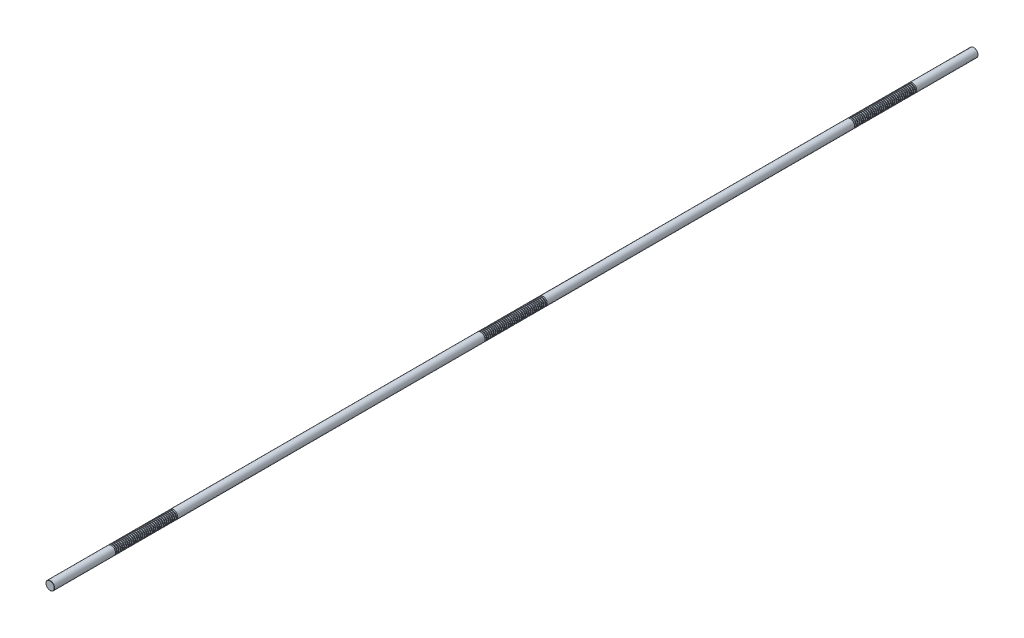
from build123d import *

# Parameters (mm, degrees)
SKETCH1_R           = 7
BOSS_EXTRUDE1_DEPTH = 750
CHAMFER1_SIZE       = 0.35
LPATTERN1_COUNT     = 34
LPATTERN1_PITCH     = 3
LPATTERN2_COUNT     = 3
LPATTERN2_PITCH     = 600


with BuildPart() as part:
    # Sketch1 → Boss-Extrude1 (new, symmetric)
    with BuildSketch(Plane.XY):
        Circle(SKETCH1_R)
    extrude(amount=BOSS_EXTRUDE1_DEPTH, both=True)

    # Chamfer1
    chamfer1_edges = [part.edges().sort_by_distance(p)[0] for p in [
        (-7, 0, -750),
        (-7, 0, 750),
    ]]
    chamfer(chamfer1_edges, length=CHAMFER1_SIZE)

    # Sketch2 → Cut-Revolve1 (revolve, cut)
    with BuildSketch(Plane(origin=(0, 0, 0), x_dir=(0, 0, -1), z_dir=(1, 0, 0)), mode=Mode.PRIVATE) as cut_revolve1_sk:
        Polygon((650.234455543, 7), (648.265544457, 7), (648.734455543, 5.25), (649.765544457, 5.25), align=None)
    cut_revolve1 = revolve(cut_revolve1_sk.sketch.rotate(Axis((0, 0, 750), (0, 0, -1)), 90), axis=Axis((0, 0, 750), (0, 0, -1)), mode=Mode.SUBTRACT)

    # LPattern1: Cut-Revolve1 ×34
    with Locations(*[(0, 0, i * LPATTERN1_PITCH) for i in range(1, LPATTERN1_COUNT)]):
        add(cut_revolve1, mode=Mode.SUBTRACT)

    # LPattern2: Cut-Revolve1 ×3
    with Locations(*[(0, 0, i * LPATTERN2_PITCH) for i in range(1, LPATTERN2_COUNT)]):
        add(cut_revolve1, mode=Mode.SUBTRACT)

    # LPattern2 copy 1 sketch → LPattern2 copy 1 (revolve, cut)
    with BuildSketch(Plane(origin=(0, 0, 603), x_dir=(0, 0, -1), z_dir=(1, 0, 0))):
        Polygon((650.234455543, 7), (648.265544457, 7), (648.734455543, 5.25), (649.765544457, 5.25), align=None)
    revolve(axis=Axis((0, 0, 1353), (0, 0, -1)), mode=Mode.SUBTRACT)

    # LPattern2 copy 2 sketch → LPattern2 copy 2 (revolve, cut)
    with BuildSketch(Plane(origin=(0, 0, 1203), x_dir=(0, 0, -1), z_dir=(1, 0, 0))):
        Polygon((650.234455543, 7), (648.265544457, 7), (648.734455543, 5.25), (649.765544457, 5.25), align=None)
    revolve(axis=Axis((0, 0, 1953), (0, 0, -1)), mode=Mode.SUBTRACT)

    # LPattern2 copy 3 sketch → LPattern2 copy 3 (revolve, cut)
    with BuildSketch(Plane(origin=(0, 0, 606), x_dir=(0, 0, -1), z_dir=(1, 0, 0))):
        Polygon((650.234455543, 7), (648.265544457, 7), (648.734455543, 5.25), (649.765544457, 5.25), align=None)
    revolve(axis=Axis((0, 0, 1356), (0, 0, -1)), mode=Mode.SUBTRACT)

    # LPattern2 copy 4 sketch → LPattern2 copy 4 (revolve, cut)
    with BuildSketch(Plane(origin=(0, 0, 1206), x_dir=(0, 0, -1), z_dir=(1, 0, 0))):
        Polygon((650.234455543, 7), (648.265544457, 7), (648.734455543, 5.25), (649.765544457, 5.25), align=None)
    revolve(axis=Axis((0, 0, 1956), (0, 0, -1)), mode=Mode.SUBTRACT)

    # LPattern2 copy 5 sketch → LPattern2 copy 5 (revolve, cut)
    with BuildSketch(Plane(origin=(0, 0, 609), x_dir=(0, 0, -1), z_dir=(1, 0, 0))):
        Polygon((650.234455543, 7), (648.265544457, 7), (648.734455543, 5.25), (649.765544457, 5.25), align=None)
    revolve(axis=Axis((0, 0, 1359), (0, 0, -1)), mode=Mode.SUBTRACT)

    # LPattern2 copy 6 sketch → LPattern2 copy 6 (revolve, cut)
    with BuildSketch(Plane(origin=(0, 0, 1209), x_dir=(0, 0, -1), z_dir=(1, 0, 0))):
        Polygon((650.234455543, 7), (648.265544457, 7), (648.734455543, 5.25), (649.765544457, 5.25), align=None)
    revolve(axis=Axis((0, 0, 1959), (0, 0, -1)), mode=Mode.SUBTRACT)

    # LPattern2 copy 7 sketch → LPattern2 copy 7 (revolve, cut)
    with BuildSketch(Plane(origin=(0, 0, 612), x_dir=(0, 0, -1), z_dir=(1, 0, 0))):
        Polygon((650.234455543, 7), (648.265544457, 7), (648.734455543, 5.25), (649.765544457, 5.25), align=None)
    revolve(axis=Axis((0, 0, 1362), (0, 0, -1)), mode=Mode.SUBTRACT)

    # LPattern2 copy 8 sketch → LPattern2 copy 8 (revolve, cut)
    with BuildSketch(Plane(origin=(0, 0, 1212), x_dir=(0, 0, -1), z_dir=(1, 0, 0))):
        Polygon((650.234455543, 7), (648.265544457, 7), (648.734455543, 5.25), (649.765544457, 5.25), align=None)
    revolve(axis=Axis((0, 0, 1962), (0, 0, -1)), mode=Mode.SUBTRACT)

    # LPattern2 copy 9 sketch → LPattern2 copy 9 (revolve, cut)
    with BuildSketch(Plane(origin=(0, 0, 615), x_dir=(0, 0, -1), z_dir=(1, 0, 0))):
        Polygon((650.234455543, 7), (648.265544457, 7), (648.734455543, 5.25), (649.765544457, 5.25), align=None)
    revolve(axis=Axis((0, 0, 1365), (0, 0, -1)), mode=Mode.SUBTRACT)

    # LPattern2 copy 10 sketch → LPattern2 copy 10 (revolve, cut)
    with BuildSketch(Plane(origin=(0, 0, 1215), x_dir=(0, 0, -1), z_dir=(1, 0, 0))):
        Polygon((650.234455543, 7), (648.265544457, 7), (648.734455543, 5.25), (649.765544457, 5.25), align=None)
    revolve(axis=Axis((0, 0, 1965), (0, 0, -1)), mode=Mode.SUBTRACT)

    # LPattern2 copy 11 sketch → LPattern2 copy 11 (revolve, cut)
    with BuildSketch(Plane(origin=(0, 0, 618), x_dir=(0, 0, -1), z_dir=(1, 0, 0))):
        Polygon((650.234455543, 7), (648.265544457, 7), (648.734455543, 5.25), (649.765544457, 5.25), align=None)
    revolve(axis=Axis((0, 0, 1368), (0, 0, -1)), mode=Mode.SUBTRACT)

    # LPattern2 copy 12 sketch → LPattern2 copy 12 (revolve, cut)
    with BuildSketch(Plane(origin=(0, 0, 1218), x_dir=(0, 0, -1), z_dir=(1, 0, 0))):
        Polygon((650.234455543, 7), (648.265544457, 7), (648.734455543, 5.25), (649.765544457, 5.25), align=None)
    revolve(axis=Axis((0, 0, 1968), (0, 0, -1)), mode=Mode.SUBTRACT)

    # LPattern2 copy 13 sketch → LPattern2 copy 13 (revolve, cut)
    with BuildSketch(Plane(origin=(0, 0, 621), x_dir=(0, 0, -1), z_dir=(1, 0, 0))):
        Polygon((650.234455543, 7), (648.265544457, 7), (648.734455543, 5.25), (649.765544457, 5.25), align=None)
    revolve(axis=Axis((0, 0, 1371), (0, 0, -1)), mode=Mode.SUBTRACT)

    # LPattern2 copy 14 sketch → LPattern2 copy 14 (revolve, cut)
    with BuildSketch(Plane(origin=(0, 0, 1221), x_dir=(0, 0, -1), z_dir=(1, 0, 0))):
        Polygon((650.234455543, 7), (648.265544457, 7), (648.734455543, 5.25), (649.765544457, 5.25), align=None)
    revolve(axis=Axis((0, 0, 1971), (0, 0, -1)), mode=Mode.SUBTRACT)

    # LPattern2 copy 15 sketch → LPattern2 copy 15 (revolve, cut)
    with BuildSketch(Plane(origin=(0, 0, 624), x_dir=(0, 0, -1), z_dir=(1, 0, 0))):
        Polygon((650.234455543, 7), (648.265544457, 7), (648.734455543, 5.25), (649.765544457, 5.25), align=None)
    revolve(axis=Axis((0, 0, 1374), (0, 0, -1)), mode=Mode.SUBTRACT)

    # LPattern2 copy 16 sketch → LPattern2 copy 16 (revolve, cut)
    with BuildSketch(Plane(origin=(0, 0, 1224), x_dir=(0, 0, -1), z_dir=(1, 0, 0))):
        Polygon((650.234455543, 7), (648.265544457, 7), (648.734455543, 5.25), (649.765544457, 5.25), align=None)
    revolve(axis=Axis((0, 0, 1974), (0, 0, -1)), mode=Mode.SUBTRACT)

    # LPattern2 copy 17 sketch → LPattern2 copy 17 (revolve, cut)
    with BuildSketch(Plane(origin=(0, 0, 627), x_dir=(0, 0, -1), z_dir=(1, 0, 0))):
        Polygon((650.234455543, 7), (648.265544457, 7), (648.734455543, 5.25), (649.765544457, 5.25), align=None)
    revolve(axis=Axis((0, 0, 1377), (0, 0, -1)), mode=Mode.SUBTRACT)

    # LPattern2 copy 18 sketch → LPattern2 copy 18 (revolve, cut)
    with BuildSketch(Plane(origin=(0, 0, 1227), x_dir=(0, 0, -1), z_dir=(1, 0, 0))):
        Polygon((650.234455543, 7), (648.265544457, 7), (648.734455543, 5.25), (649.765544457, 5.25), align=None)
    revolve(axis=Axis((0, 0, 1977), (0, 0, -1)), mode=Mode.SUBTRACT)

    # LPattern2 copy 19 sketch → LPattern2 copy 19 (revolve, cut)
    with BuildSketch(Plane(origin=(0, 0, 630), x_dir=(0, 0, -1), z_dir=(1, 0, 0))):
        Polygon((650.234455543, 7), (648.265544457, 7), (648.734455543, 5.25), (649.765544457, 5.25), align=None)
    revolve(axis=Axis((0, 0, 1380), (0, 0, -1)), mode=Mode.SUBTRACT)

    # LPattern2 copy 20 sketch → LPattern2 copy 20 (revolve, cut)
    with BuildSketch(Plane(origin=(0, 0, 1230), x_dir=(0, 0, -1), z_dir=(1, 0, 0))):
        Polygon((650.234455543, 7), (648.265544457, 7), (648.734455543, 5.25), (649.765544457, 5.25), align=None)
    revolve(axis=Axis((0, 0, 1980), (0, 0, -1)), mode=Mode.SUBTRACT)

    # LPattern2 copy 21 sketch → LPattern2 copy 21 (revolve, cut)
    with BuildSketch(Plane(origin=(0, 0, 633), x_dir=(0, 0, -1), z_dir=(1, 0, 0))):
        Polygon((650.234455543, 7), (648.265544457, 7), (648.734455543, 5.25), (649.765544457, 5.25), align=None)
    revolve(axis=Axis((0, 0, 1383), (0, 0, -1)), mode=Mode.SUBTRACT)

    # LPattern2 copy 22 sketch → LPattern2 copy 22 (revolve, cut)
    with BuildSketch(Plane(origin=(0, 0, 1233), x_dir=(0, 0, -1), z_dir=(1, 0, 0))):
        Polygon((650.234455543, 7), (648.265544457, 7), (648.734455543, 5.25), (649.765544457, 5.25), align=None)
    revolve(axis=Axis((0, 0, 1983), (0, 0, -1)), mode=Mode.SUBTRACT)

    # LPattern2 copy 23 sketch → LPattern2 copy 23 (revolve, cut)
    with BuildSketch(Plane(origin=(0, 0, 636), x_dir=(0, 0, -1), z_dir=(1, 0, 0))):
        Polygon((650.234455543, 7), (648.265544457, 7), (648.734455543, 5.25), (649.765544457, 5.25), align=None)
    revolve(axis=Axis((0, 0, 1386), (0, 0, -1)), mode=Mode.SUBTRACT)

    # LPattern2 copy 24 sketch → LPattern2 copy 24 (revolve, cut)
    with BuildSketch(Plane(origin=(0, 0, 1236), x_dir=(0, 0, -1), z_dir=(1, 0, 0))):
        Polygon((650.234455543, 7), (648.265544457, 7), (648.734455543, 5.25), (649.765544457, 5.25), align=None)
    revolve(axis=Axis((0, 0, 1986), (0, 0, -1)), mode=Mode.SUBTRACT)

    # LPattern2 copy 25 sketch → LPattern2 copy 25 (revolve, cut)
    with BuildSketch(Plane(origin=(0, 0, 639), x_dir=(0, 0, -1), z_dir=(1, 0, 0))):
        Polygon((650.234455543, 7), (648.265544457, 7), (648.734455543, 5.25), (649.765544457, 5.25), align=None)
    revolve(axis=Axis((0, 0, 1389), (0, 0, -1)), mode=Mode.SUBTRACT)

    # LPattern2 copy 26 sketch → LPattern2 copy 26 (revolve, cut)
    with BuildSketch(Plane(origin=(0, 0, 1239), x_dir=(0, 0, -1), z_dir=(1, 0, 0))):
        Polygon((650.234455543, 7), (648.265544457, 7), (648.734455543, 5.25), (649.765544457, 5.25), align=None)
    revolve(axis=Axis((0, 0, 1989), (0, 0, -1)), mode=Mode.SUBTRACT)

    # LPattern2 copy 27 sketch → LPattern2 copy 27 (revolve, cut)
    with BuildSketch(Plane(origin=(0, 0, 642), x_dir=(0, 0, -1), z_dir=(1, 0, 0))):
        Polygon((650.234455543, 7), (648.265544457, 7), (648.734455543, 5.25), (649.765544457, 5.25), align=None)
    revolve(axis=Axis((0, 0, 1392), (0, 0, -1)), mode=Mode.SUBTRACT)

    # LPattern2 copy 28 sketch → LPattern2 copy 28 (revolve, cut)
    with BuildSketch(Plane(origin=(0, 0, 1242), x_dir=(0, 0, -1), z_dir=(1, 0, 0))):
        Polygon((650.234455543, 7), (648.265544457, 7), (648.734455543, 5.25), (649.765544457, 5.25), align=None)
    revolve(axis=Axis((0, 0, 1992), (0, 0, -1)), mode=Mode.SUBTRACT)

    # LPattern2 copy 29 sketch → LPattern2 copy 29 (revolve, cut)
    with BuildSketch(Plane(origin=(0, 0, 645), x_dir=(0, 0, -1), z_dir=(1, 0, 0))):
        Polygon((650.234455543, 7), (648.265544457, 7), (648.734455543, 5.25), (649.765544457, 5.25), align=None)
    revolve(axis=Axis((0, 0, 1395), (0, 0, -1)), mode=Mode.SUBTRACT)

    # LPattern2 copy 30 sketch → LPattern2 copy 30 (revolve, cut)
    with BuildSketch(Plane(origin=(0, 0, 1245), x_dir=(0, 0, -1), z_dir=(1, 0, 0))):
        Polygon((650.234455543, 7), (648.265544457, 7), (648.734455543, 5.25), (649.765544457, 5.25), align=None)
    revolve(axis=Axis((0, 0, 1995), (0, 0, -1)), mode=Mode.SUBTRACT)

    # LPattern2 copy 31 sketch → LPattern2 copy 31 (revolve, cut)
    with BuildSketch(Plane(origin=(0, 0, 648), x_dir=(0, 0, -1), z_dir=(1, 0, 0))):
        Polygon((650.234455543, 7), (648.265544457, 7), (648.734455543, 5.25), (649.765544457, 5.25), align=None)
    revolve(axis=Axis((0, 0, 1398), (0, 0, -1)), mode=Mode.SUBTRACT)

    # LPattern2 copy 32 sketch → LPattern2 copy 32 (revolve, cut)
    with BuildSketch(Plane(origin=(0, 0, 1248), x_dir=(0, 0, -1), z_dir=(1, 0, 0))):
        Polygon((650.234455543, 7), (648.265544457, 7), (648.734455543, 5.25), (649.765544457, 5.25), align=None)
    revolve(axis=Axis((0, 0, 1998), (0, 0, -1)), mode=Mode.SUBTRACT)

    # LPattern2 copy 33 sketch → LPattern2 copy 33 (revolve, cut)
    with BuildSketch(Plane(origin=(0, 0, 651), x_dir=(0, 0, -1), z_dir=(1, 0, 0))):
        Polygon((650.234455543, 7), (648.265544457, 7), (648.734455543, 5.25), (649.765544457, 5.25), align=None)
    revolve(axis=Axis((0, 0, 1401), (0, 0, -1)), mode=Mode.SUBTRACT)

    # LPattern2 copy 34 sketch → LPattern2 copy 34 (revolve, cut)
    with BuildSketch(Plane(origin=(0, 0, 1251), x_dir=(0, 0, -1), z_dir=(1, 0, 0))):
        Polygon((650.234455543, 7), (648.265544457, 7), (648.734455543, 5.25), (649.765544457, 5.25), align=None)
    revolve(axis=Axis((0, 0, 2001), (0, 0, -1)), mode=Mode.SUBTRACT)

    # LPattern2 copy 35 sketch → LPattern2 copy 35 (revolve, cut)
    with BuildSketch(Plane(origin=(0, 0, 654), x_dir=(0, 0, -1), z_dir=(1, 0, 0))):
        Polygon((650.234455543, 7), (648.265544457, 7), (648.734455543, 5.25), (649.765544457, 5.25), align=None)
    revolve(axis=Axis((0, 0, 1404), (0, 0, -1)), mode=Mode.SUBTRACT)

    # LPattern2 copy 36 sketch → LPattern2 copy 36 (revolve, cut)
    with BuildSketch(Plane(origin=(0, 0, 1254), x_dir=(0, 0, -1), z_dir=(1, 0, 0))):
        Polygon((650.234455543, 7), (648.265544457, 7), (648.734455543, 5.25), (649.765544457, 5.25), align=None)
    revolve(axis=Axis((0, 0, 2004), (0, 0, -1)), mode=Mode.SUBTRACT)

    # LPattern2 copy 37 sketch → LPattern2 copy 37 (revolve, cut)
    with BuildSketch(Plane(origin=(0, 0, 657), x_dir=(0, 0, -1), z_dir=(1, 0, 0))):
        Polygon((650.234455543, 7), (648.265544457, 7), (648.734455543, 5.25), (649.765544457, 5.25), align=None)
    revolve(axis=Axis((0, 0, 1407), (0, 0, -1)), mode=Mode.SUBTRACT)

    # LPattern2 copy 38 sketch → LPattern2 copy 38 (revolve, cut)
    with BuildSketch(Plane(origin=(0, 0, 1257), x_dir=(0, 0, -1), z_dir=(1, 0, 0))):
        Polygon((650.234455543, 7), (648.265544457, 7), (648.734455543, 5.25), (649.765544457, 5.25), align=None)
    revolve(axis=Axis((0, 0, 2007), (0, 0, -1)), mode=Mode.SUBTRACT)

    # LPattern2 copy 39 sketch → LPattern2 copy 39 (revolve, cut)
    with BuildSketch(Plane(origin=(0, 0, 660), x_dir=(0, 0, -1), z_dir=(1, 0, 0))):
        Polygon((650.234455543, 7), (648.265544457, 7), (648.734455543, 5.25), (649.765544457, 5.25), align=None)
    revolve(axis=Axis((0, 0, 1410), (0, 0, -1)), mode=Mode.SUBTRACT)

    # LPattern2 copy 40 sketch → LPattern2 copy 40 (revolve, cut)
    with BuildSketch(Plane(origin=(0, 0, 1260), x_dir=(0, 0, -1), z_dir=(1, 0, 0))):
        Polygon((650.234455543, 7), (648.265544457, 7), (648.734455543, 5.25), (649.765544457, 5.25), align=None)
    revolve(axis=Axis((0, 0, 2010), (0, 0, -1)), mode=Mode.SUBTRACT)

    # LPattern2 copy 41 sketch → LPattern2 copy 41 (revolve, cut)
    with BuildSketch(Plane(origin=(0, 0, 663), x_dir=(0, 0, -1), z_dir=(1, 0, 0))):
        Polygon((650.234455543, 7), (648.265544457, 7), (648.734455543, 5.25), (649.765544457, 5.25), align=None)
    revolve(axis=Axis((0, 0, 1413), (0, 0, -1)), mode=Mode.SUBTRACT)

    # LPattern2 copy 42 sketch → LPattern2 copy 42 (revolve, cut)
    with BuildSketch(Plane(origin=(0, 0, 1263), x_dir=(0, 0, -1), z_dir=(1, 0, 0))):
        Polygon((650.234455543, 7), (648.265544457, 7), (648.734455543, 5.25), (649.765544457, 5.25), align=None)
    revolve(axis=Axis((0, 0, 2013), (0, 0, -1)), mode=Mode.SUBTRACT)

    # LPattern2 copy 43 sketch → LPattern2 copy 43 (revolve, cut)
    with BuildSketch(Plane(origin=(0, 0, 666), x_dir=(0, 0, -1), z_dir=(1, 0, 0))):
        Polygon((650.234455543, 7), (648.265544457, 7), (648.734455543, 5.25), (649.765544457, 5.25), align=None)
    revolve(axis=Axis((0, 0, 1416), (0, 0, -1)), mode=Mode.SUBTRACT)

    # LPattern2 copy 44 sketch → LPattern2 copy 44 (revolve, cut)
    with BuildSketch(Plane(origin=(0, 0, 1266), x_dir=(0, 0, -1), z_dir=(1, 0, 0))):
        Polygon((650.234455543, 7), (648.265544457, 7), (648.734455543, 5.25), (649.765544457, 5.25), align=None)
    revolve(axis=Axis((0, 0, 2016), (0, 0, -1)), mode=Mode.SUBTRACT)

    # LPattern2 copy 45 sketch → LPattern2 copy 45 (revolve, cut)
    with BuildSketch(Plane(origin=(0, 0, 669), x_dir=(0, 0, -1), z_dir=(1, 0, 0))):
        Polygon((650.234455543, 7), (648.265544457, 7), (648.734455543, 5.25), (649.765544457, 5.25), align=None)
    revolve(axis=Axis((0, 0, 1419), (0, 0, -1)), mode=Mode.SUBTRACT)

    # LPattern2 copy 46 sketch → LPattern2 copy 46 (revolve, cut)
    with BuildSketch(Plane(origin=(0, 0, 1269), x_dir=(0, 0, -1), z_dir=(1, 0, 0))):
        Polygon((650.234455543, 7), (648.265544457, 7), (648.734455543, 5.25), (649.765544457, 5.25), align=None)
    revolve(axis=Axis((0, 0, 2019), (0, 0, -1)), mode=Mode.SUBTRACT)

    # LPattern2 copy 47 sketch → LPattern2 copy 47 (revolve, cut)
    with BuildSketch(Plane(origin=(0, 0, 672), x_dir=(0, 0, -1), z_dir=(1, 0, 0))):
        Polygon((650.234455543, 7), (648.265544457, 7), (648.734455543, 5.25), (649.765544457, 5.25), align=None)
    revolve(axis=Axis((0, 0, 1422), (0, 0, -1)), mode=Mode.SUBTRACT)

    # LPattern2 copy 48 sketch → LPattern2 copy 48 (revolve, cut)
    with BuildSketch(Plane(origin=(0, 0, 1272), x_dir=(0, 0, -1), z_dir=(1, 0, 0))):
        Polygon((650.234455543, 7), (648.265544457, 7), (648.734455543, 5.25), (649.765544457, 5.25), align=None)
    revolve(axis=Axis((0, 0, 2022), (0, 0, -1)), mode=Mode.SUBTRACT)

    # LPattern2 copy 49 sketch → LPattern2 copy 49 (revolve, cut)
    with BuildSketch(Plane(origin=(0, 0, 675), x_dir=(0, 0, -1), z_dir=(1, 0, 0))):
        Polygon((650.234455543, 7), (648.265544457, 7), (648.734455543, 5.25), (649.765544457, 5.25), align=None)
    revolve(axis=Axis((0, 0, 1425), (0, 0, -1)), mode=Mode.SUBTRACT)

    # LPattern2 copy 50 sketch → LPattern2 copy 50 (revolve, cut)
    with BuildSketch(Plane(origin=(0, 0, 1275), x_dir=(0, 0, -1), z_dir=(1, 0, 0))):
        Polygon((650.234455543, 7), (648.265544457, 7), (648.734455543, 5.25), (649.765544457, 5.25), align=None)
    revolve(axis=Axis((0, 0, 2025), (0, 0, -1)), mode=Mode.SUBTRACT)

    # LPattern2 copy 51 sketch → LPattern2 copy 51 (revolve, cut)
    with BuildSketch(Plane(origin=(0, 0, 678), x_dir=(0, 0, -1), z_dir=(1, 0, 0))):
        Polygon((650.234455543, 7), (648.265544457, 7), (648.734455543, 5.25), (649.765544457, 5.25), align=None)
    revolve(axis=Axis((0, 0, 1428), (0, 0, -1)), mode=Mode.SUBTRACT)

    # LPattern2 copy 52 sketch → LPattern2 copy 52 (revolve, cut)
    with BuildSketch(Plane(origin=(0, 0, 1278), x_dir=(0, 0, -1), z_dir=(1, 0, 0))):
        Polygon((650.234455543, 7), (648.265544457, 7), (648.734455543, 5.25), (649.765544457, 5.25), align=None)
    revolve(axis=Axis((0, 0, 2028), (0, 0, -1)), mode=Mode.SUBTRACT)

    # LPattern2 copy 53 sketch → LPattern2 copy 53 (revolve, cut)
    with BuildSketch(Plane(origin=(0, 0, 681), x_dir=(0, 0, -1), z_dir=(1, 0, 0))):
        Polygon((650.234455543, 7), (648.265544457, 7), (648.734455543, 5.25), (649.765544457, 5.25), align=None)
    revolve(axis=Axis((0, 0, 1431), (0, 0, -1)), mode=Mode.SUBTRACT)

    # LPattern2 copy 54 sketch → LPattern2 copy 54 (revolve, cut)
    with BuildSketch(Plane(origin=(0, 0, 1281), x_dir=(0, 0, -1), z_dir=(1, 0, 0))):
        Polygon((650.234455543, 7), (648.265544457, 7), (648.734455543, 5.25), (649.765544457, 5.25), align=None)
    revolve(axis=Axis((0, 0, 2031), (0, 0, -1)), mode=Mode.SUBTRACT)

    # LPattern2 copy 55 sketch → LPattern2 copy 55 (revolve, cut)
    with BuildSketch(Plane(origin=(0, 0, 684), x_dir=(0, 0, -1), z_dir=(1, 0, 0))):
        Polygon((650.234455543, 7), (648.265544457, 7), (648.734455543, 5.25), (649.765544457, 5.25), align=None)
    revolve(axis=Axis((0, 0, 1434), (0, 0, -1)), mode=Mode.SUBTRACT)

    # LPattern2 copy 56 sketch → LPattern2 copy 56 (revolve, cut)
    with BuildSketch(Plane(origin=(0, 0, 1284), x_dir=(0, 0, -1), z_dir=(1, 0, 0))):
        Polygon((650.234455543, 7), (648.265544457, 7), (648.734455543, 5.25), (649.765544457, 5.25), align=None)
    revolve(axis=Axis((0, 0, 2034), (0, 0, -1)), mode=Mode.SUBTRACT)

    # LPattern2 copy 57 sketch → LPattern2 copy 57 (revolve, cut)
    with BuildSketch(Plane(origin=(0, 0, 687), x_dir=(0, 0, -1), z_dir=(1, 0, 0))):
        Polygon((650.234455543, 7), (648.265544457, 7), (648.734455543, 5.25), (649.765544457, 5.25), align=None)
    revolve(axis=Axis((0, 0, 1437), (0, 0, -1)), mode=Mode.SUBTRACT)

    # LPattern2 copy 58 sketch → LPattern2 copy 58 (revolve, cut)
    with BuildSketch(Plane(origin=(0, 0, 1287), x_dir=(0, 0, -1), z_dir=(1, 0, 0))):
        Polygon((650.234455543, 7), (648.265544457, 7), (648.734455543, 5.25), (649.765544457, 5.25), align=None)
    revolve(axis=Axis((0, 0, 2037), (0, 0, -1)), mode=Mode.SUBTRACT)

    # LPattern2 copy 59 sketch → LPattern2 copy 59 (revolve, cut)
    with BuildSketch(Plane(origin=(0, 0, 690), x_dir=(0, 0, -1), z_dir=(1, 0, 0))):
        Polygon((650.234455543, 7), (648.265544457, 7), (648.734455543, 5.25), (649.765544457, 5.25), align=None)
    revolve(axis=Axis((0, 0, 1440), (0, 0, -1)), mode=Mode.SUBTRACT)

    # LPattern2 copy 60 sketch → LPattern2 copy 60 (revolve, cut)
    with BuildSketch(Plane(origin=(0, 0, 1290), x_dir=(0, 0, -1), z_dir=(1, 0, 0))):
        Polygon((650.234455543, 7), (648.265544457, 7), (648.734455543, 5.25), (649.765544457, 5.25), align=None)
    revolve(axis=Axis((0, 0, 2040), (0, 0, -1)), mode=Mode.SUBTRACT)

    # LPattern2 copy 61 sketch → LPattern2 copy 61 (revolve, cut)
    with BuildSketch(Plane(origin=(0, 0, 693), x_dir=(0, 0, -1), z_dir=(1, 0, 0))):
        Polygon((650.234455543, 7), (648.265544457, 7), (648.734455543, 5.25), (649.765544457, 5.25), align=None)
    revolve(axis=Axis((0, 0, 1443), (0, 0, -1)), mode=Mode.SUBTRACT)

    # LPattern2 copy 62 sketch → LPattern2 copy 62 (revolve, cut)
    with BuildSketch(Plane(origin=(0, 0, 1293), x_dir=(0, 0, -1), z_dir=(1, 0, 0))):
        Polygon((650.234455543, 7), (648.265544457, 7), (648.734455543, 5.25), (649.765544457, 5.25), align=None)
    revolve(axis=Axis((0, 0, 2043), (0, 0, -1)), mode=Mode.SUBTRACT)

    # LPattern2 copy 63 sketch → LPattern2 copy 63 (revolve, cut)
    with BuildSketch(Plane(origin=(0, 0, 696), x_dir=(0, 0, -1), z_dir=(1, 0, 0))):
        Polygon((650.234455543, 7), (648.265544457, 7), (648.734455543, 5.25), (649.765544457, 5.25), align=None)
    revolve(axis=Axis((0, 0, 1446), (0, 0, -1)), mode=Mode.SUBTRACT)

    # LPattern2 copy 64 sketch → LPattern2 copy 64 (revolve, cut)
    with BuildSketch(Plane(origin=(0, 0, 1296), x_dir=(0, 0, -1), z_dir=(1, 0, 0))):
        Polygon((650.234455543, 7), (648.265544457, 7), (648.734455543, 5.25), (649.765544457, 5.25), align=None)
    revolve(axis=Axis((0, 0, 2046), (0, 0, -1)), mode=Mode.SUBTRACT)

    # LPattern2 copy 65 sketch → LPattern2 copy 65 (revolve, cut)
    with BuildSketch(Plane(origin=(0, 0, 699), x_dir=(0, 0, -1), z_dir=(1, 0, 0))):
        Polygon((650.234455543, 7), (648.265544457, 7), (648.734455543, 5.25), (649.765544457, 5.25), align=None)
    revolve(axis=Axis((0, 0, 1449), (0, 0, -1)), mode=Mode.SUBTRACT)

    # LPattern2 copy 66 sketch → LPattern2 copy 66 (revolve, cut)
    with BuildSketch(Plane(origin=(0, 0, 1299), x_dir=(0, 0, -1), z_dir=(1, 0, 0))):
        Polygon((650.234455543, 7), (648.265544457, 7), (648.734455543, 5.25), (649.765544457, 5.25), align=None)
    revolve(axis=Axis((0, 0, 2049), (0, 0, -1)), mode=Mode.SUBTRACT)


solid = part.part
